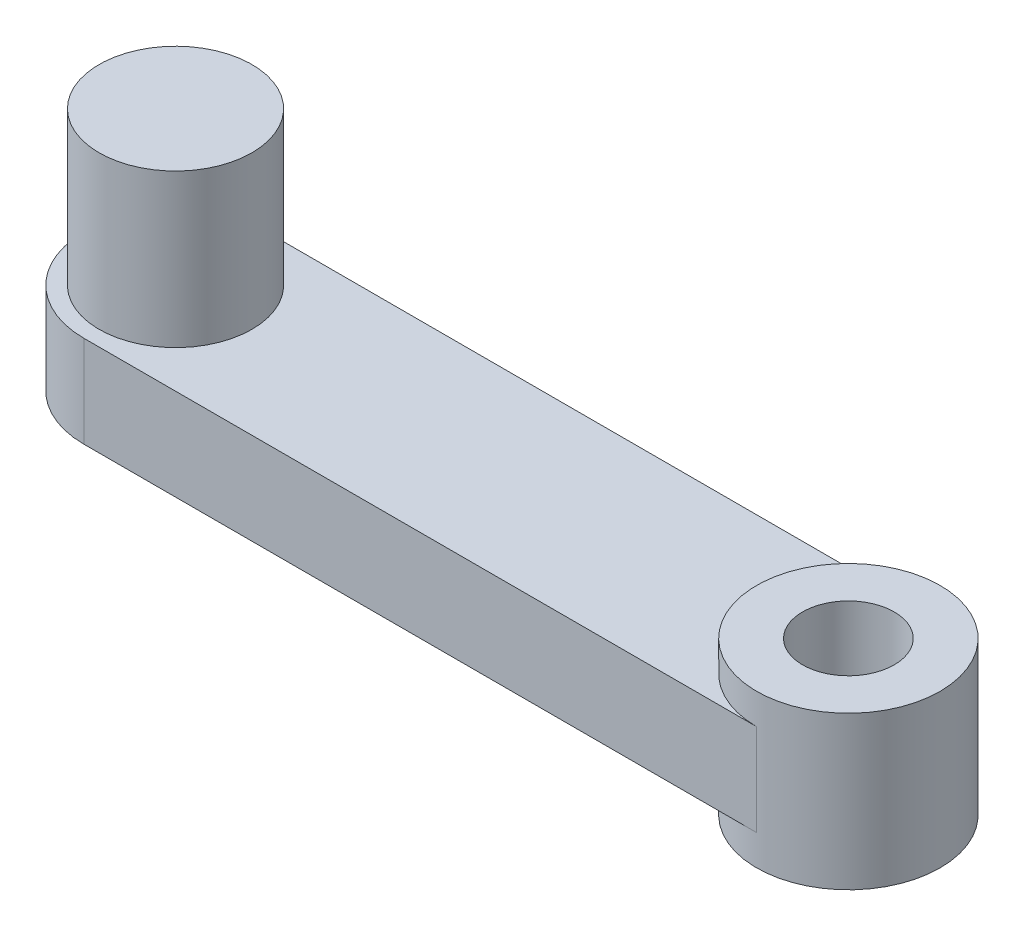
ISO-10303-21;
HEADER;
FILE_DESCRIPTION(('STEP AP214'),'2;1');
FILE_NAME('part.step','',(''),(''),'','','');
FILE_SCHEMA(('AUTOMOTIVE_DESIGN { 1 0 10303 214 1 1 1 1 }'));
ENDSEC;
DATA;
#1=APPLICATION_CONTEXT('core data for automotive mechanical design processes');
#2=APPLICATION_PROTOCOL_DEFINITION('international standard','automotive_design',2000,#1);
#3=PRODUCT_CONTEXT('',#1,'mechanical');
#4=PRODUCT('Part','Part','',(#3));
#5=PRODUCT_RELATED_PRODUCT_CATEGORY('part','',(#4));
#6=PRODUCT_DEFINITION_FORMATION('','',#4);
#7=PRODUCT_DEFINITION_CONTEXT('part definition',#1,'design');
#8=PRODUCT_DEFINITION('design','',#6,#7);
#9=PRODUCT_DEFINITION_SHAPE('','',#8);
#10=(LENGTH_UNIT() NAMED_UNIT(*) SI_UNIT(.MILLI.,.METRE.));
#11=(NAMED_UNIT(*) PLANE_ANGLE_UNIT() SI_UNIT($,.RADIAN.));
#12=(NAMED_UNIT(*) SI_UNIT($,.STERADIAN.) SOLID_ANGLE_UNIT());
#13=UNCERTAINTY_MEASURE_WITH_UNIT(LENGTH_MEASURE(1.E-05),#10,'distance_accuracy_value','');
#14=(GEOMETRIC_REPRESENTATION_CONTEXT(3) GLOBAL_UNCERTAINTY_ASSIGNED_CONTEXT((#13)) GLOBAL_UNIT_ASSIGNED_CONTEXT((#10,
#11,#12)) REPRESENTATION_CONTEXT('',''));
#15=CARTESIAN_POINT('',(0.,0.,0.));
#16=DIRECTION('',(0.,0.,1.));
#17=DIRECTION('',(1.,0.,0.));
#18=AXIS2_PLACEMENT_3D('',#15,#16,#17);
#19=CARTESIAN_POINT('',(0.,8.00000000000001,0.));
#20=DIRECTION('',(0.,1.,0.));
#21=DIRECTION('',(-1.,0.,0.));
#22=AXIS2_PLACEMENT_3D('',#19,#20,#21);
#23=PLANE('',#22);
#24=CARTESIAN_POINT('',(0.,8.00000000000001,0.));
#25=DIRECTION('',(0.,-1.,0.));
#26=DIRECTION('',(1.,0.,0.));
#27=AXIS2_PLACEMENT_3D('',#24,#25,#26);
#28=CIRCLE('',#27,2.5);
#29=CARTESIAN_POINT('',(2.49999999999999,8.00000000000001,0.));
#30=VERTEX_POINT('',#29);
#31=EDGE_CURVE('E20',#30,#30,#28,.T.);
#32=ORIENTED_EDGE('',*,*,#31,.F.);
#33=EDGE_LOOP('',(#32));
#34=FACE_BOUND('',#33,.T.);
#35=ADVANCED_FACE('F17',(#34),#23,.T.);
#36=CARTESIAN_POINT('',(22.,3.00000000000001,0.));
#37=DIRECTION('',(0.,-1.,0.));
#38=DIRECTION('',(1.,0.,0.));
#39=AXIS2_PLACEMENT_3D('',#36,#37,#38);
#40=CYLINDRICAL_SURFACE('',#39,1.5);
#41=CARTESIAN_POINT('',(22.,-0.999999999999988,0.));
#42=DIRECTION('',(0.,-1.,0.));
#43=DIRECTION('',(1.,0.,0.));
#44=AXIS2_PLACEMENT_3D('',#41,#42,#43);
#45=CIRCLE('',#44,1.5);
#46=CARTESIAN_POINT('',(23.5,-0.999999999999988,0.));
#47=VERTEX_POINT('',#46);
#48=EDGE_CURVE('E65',#47,#47,#45,.T.);
#49=ORIENTED_EDGE('',*,*,#48,.T.);
#50=EDGE_LOOP('',(#49));
#51=FACE_BOUND('',#50,.T.);
#52=CARTESIAN_POINT('',(22.,4.,0.));
#53=DIRECTION('',(0.,-1.,0.));
#54=DIRECTION('',(1.,0.,0.));
#55=AXIS2_PLACEMENT_3D('',#52,#53,#54);
#56=CIRCLE('',#55,1.5);
#57=CARTESIAN_POINT('',(23.5,4.,0.));
#58=VERTEX_POINT('',#57);
#59=EDGE_CURVE('E105',#58,#58,#56,.T.);
#60=ORIENTED_EDGE('',*,*,#59,.F.);
#61=EDGE_LOOP('',(#60));
#62=FACE_BOUND('',#61,.T.);
#63=ADVANCED_FACE('F115',(#51,#62),#40,.F.);
#64=CARTESIAN_POINT('',(0.,8.00000000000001,0.));
#65=DIRECTION('',(0.,-1.,0.));
#66=DIRECTION('',(1.,0.,0.));
#67=AXIS2_PLACEMENT_3D('',#64,#65,#66);
#68=CYLINDRICAL_SURFACE('',#67,2.5);
#69=CARTESIAN_POINT('',(0.,3.,0.));
#70=DIRECTION('',(0.,-1.,0.));
#71=DIRECTION('',(1.,0.,0.));
#72=AXIS2_PLACEMENT_3D('',#69,#70,#71);
#73=CIRCLE('',#72,2.5);
#74=CARTESIAN_POINT('',(2.49999999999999,3.,0.));
#75=VERTEX_POINT('',#74);
#76=EDGE_CURVE('E64',#75,#75,#73,.T.);
#77=ORIENTED_EDGE('',*,*,#76,.F.);
#78=EDGE_LOOP('',(#77));
#79=FACE_BOUND('',#78,.T.);
#80=ORIENTED_EDGE('',*,*,#31,.T.);
#81=EDGE_LOOP('',(#80));
#82=FACE_BOUND('',#81,.T.);
#83=ADVANCED_FACE('F112',(#79,#82),#68,.T.);
#84=CARTESIAN_POINT('',(22.,4.,0.));
#85=DIRECTION('',(0.,1.,0.));
#86=DIRECTION('',(-1.,0.,0.));
#87=AXIS2_PLACEMENT_3D('',#84,#85,#86);
#88=PLANE('',#87);
#89=CARTESIAN_POINT('',(22.,4.,0.));
#90=DIRECTION('',(0.,-1.,0.));
#91=DIRECTION('',(1.,0.,0.));
#92=AXIS2_PLACEMENT_3D('',#89,#90,#91);
#93=CIRCLE('',#92,3.);
#94=CARTESIAN_POINT('',(25.,4.,0.));
#95=VERTEX_POINT('',#94);
#96=EDGE_CURVE('E99',#95,#95,#93,.T.);
#97=ORIENTED_EDGE('',*,*,#96,.F.);
#98=EDGE_LOOP('',(#97));
#99=FACE_BOUND('',#98,.T.);
#100=ORIENTED_EDGE('',*,*,#59,.T.);
#101=EDGE_LOOP('',(#100));
#102=FACE_BOUND('',#101,.T.);
#103=ADVANCED_FACE('F155',(#99,#102),#88,.T.);
#104=CARTESIAN_POINT('',(0.,3.,0.));
#105=DIRECTION('',(0.,1.,0.));
#106=DIRECTION('',(-1.,0.,0.));
#107=AXIS2_PLACEMENT_3D('',#104,#105,#106);
#108=PLANE('',#107);
#109=CARTESIAN_POINT('',(0.,3.,0.));
#110=DIRECTION('',(0.,-1.,0.));
#111=DIRECTION('',(1.,0.,0.));
#112=AXIS2_PLACEMENT_3D('',#109,#110,#111);
#113=CIRCLE('',#112,1.5);
#114=CARTESIAN_POINT('',(1.49999999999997,3.,0.));
#115=VERTEX_POINT('',#114);
#116=EDGE_CURVE('E96',#115,#115,#113,.T.);
#117=ORIENTED_EDGE('',*,*,#116,.T.);
#118=EDGE_LOOP('',(#117));
#119=FACE_BOUND('',#118,.T.);
#120=ADVANCED_FACE('F151',(#119),#108,.F.);
#121=CARTESIAN_POINT('',(22.,-0.999999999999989,0.));
#122=DIRECTION('',(0.,1.,0.));
#123=DIRECTION('',(-1.,0.,0.));
#124=AXIS2_PLACEMENT_3D('',#121,#122,#123);
#125=PLANE('',#124);
#126=CARTESIAN_POINT('',(22.,-0.999999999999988,0.));
#127=DIRECTION('',(0.,-1.,0.));
#128=DIRECTION('',(1.,0.,0.));
#129=AXIS2_PLACEMENT_3D('',#126,#127,#128);
#130=CIRCLE('',#129,3.);
#131=CARTESIAN_POINT('',(25.,-0.999999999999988,0.));
#132=VERTEX_POINT('',#131);
#133=EDGE_CURVE('E75',#132,#132,#130,.F.);
#134=ORIENTED_EDGE('',*,*,#133,.F.);
#135=EDGE_LOOP('',(#134));
#136=FACE_BOUND('',#135,.T.);
#137=ORIENTED_EDGE('',*,*,#48,.F.);
#138=EDGE_LOOP('',(#137));
#139=FACE_BOUND('',#138,.T.);
#140=ADVANCED_FACE('F147',(#136,#139),#125,.F.);
#141=CARTESIAN_POINT('',(0.,3.,0.));
#142=DIRECTION('',(0.,1.,0.));
#143=DIRECTION('',(-1.,0.,0.));
#144=AXIS2_PLACEMENT_3D('',#141,#142,#143);
#145=PLANE('',#144);
#146=ORIENTED_EDGE('',*,*,#76,.T.);
#147=EDGE_LOOP('',(#146));
#148=FACE_BOUND('',#147,.T.);
#149=CARTESIAN_POINT('',(0.,3.,0.));
#150=DIRECTION('',(0.,-1.,0.));
#151=DIRECTION('',(1.,0.,0.));
#152=AXIS2_PLACEMENT_3D('',#149,#150,#151);
#153=CIRCLE('',#152,3.);
#154=CARTESIAN_POINT('',(8.97998446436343E-08,3.,3.00000000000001));
#155=VERTEX_POINT('',#154);
#156=CARTESIAN_POINT('',(0.,3.00000000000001,-3.));
#157=VERTEX_POINT('',#156);
#158=EDGE_CURVE('E78',#155,#157,#153,.T.);
#159=ORIENTED_EDGE('',*,*,#158,.F.);
#160=DIRECTION('',(1.,0.,0.));
#161=VECTOR('',#160,1.);
#162=CARTESIAN_POINT('',(0.,3.,3.00000000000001));
#163=LINE('',#162,#161);
#164=CARTESIAN_POINT('',(22.,3.,3.00000000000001));
#165=VERTEX_POINT('',#164);
#166=EDGE_CURVE('E71',#155,#165,#163,.T.);
#167=ORIENTED_EDGE('',*,*,#166,.T.);
#168=CARTESIAN_POINT('',(22.,3.,0.));
#169=DIRECTION('',(0.,-1.,0.));
#170=DIRECTION('',(1.,0.,0.));
#171=AXIS2_PLACEMENT_3D('',#168,#169,#170);
#172=CIRCLE('',#171,3.);
#173=CARTESIAN_POINT('',(21.9999998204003,3.00000000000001,-3.));
#174=VERTEX_POINT('',#173);
#175=EDGE_CURVE('E54',#165,#174,#172,.T.);
#176=ORIENTED_EDGE('',*,*,#175,.T.);
#177=DIRECTION('',(1.,0.,0.));
#178=VECTOR('',#177,1.);
#179=CARTESIAN_POINT('',(0.,3.00000000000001,-3.));
#180=LINE('',#179,#178);
#181=EDGE_CURVE('E84',#157,#174,#180,.T.);
#182=ORIENTED_EDGE('',*,*,#181,.F.);
#183=EDGE_LOOP('',(#159,#167,#176,#182));
#184=FACE_BOUND('',#183,.T.);
#185=ADVANCED_FACE('F77',(#148,#184),#145,.T.);
#186=CARTESIAN_POINT('',(0.,3.,0.));
#187=DIRECTION('',(0.,-1.,0.));
#188=DIRECTION('',(1.,0.,0.));
#189=AXIS2_PLACEMENT_3D('',#186,#187,#188);
#190=CYLINDRICAL_SURFACE('',#189,1.5);
#191=CARTESIAN_POINT('',(0.,0.,0.));
#192=DIRECTION('',(0.,-1.,0.));
#193=DIRECTION('',(1.,0.,0.));
#194=AXIS2_PLACEMENT_3D('',#191,#192,#193);
#195=CIRCLE('',#194,1.5);
#196=CARTESIAN_POINT('',(1.49999999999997,0.,0.));
#197=VERTEX_POINT('',#196);
#198=EDGE_CURVE('E89',#197,#197,#195,.T.);
#199=ORIENTED_EDGE('',*,*,#198,.T.);
#200=EDGE_LOOP('',(#199));
#201=FACE_BOUND('',#200,.T.);
#202=ORIENTED_EDGE('',*,*,#116,.F.);
#203=EDGE_LOOP('',(#202));
#204=FACE_BOUND('',#203,.T.);
#205=ADVANCED_FACE('F140',(#201,#204),#190,.F.);
#206=CARTESIAN_POINT('',(0.,3.,0.));
#207=DIRECTION('',(0.,-1.,0.));
#208=DIRECTION('',(1.,0.,0.));
#209=AXIS2_PLACEMENT_3D('',#206,#207,#208);
#210=CYLINDRICAL_SURFACE('',#209,3.);
#211=ORIENTED_EDGE('',*,*,#158,.T.);
#212=DIRECTION('',(0.,1.,0.));
#213=VECTOR('',#212,1.);
#214=CARTESIAN_POINT('',(0.,3.00000000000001,-3.));
#215=LINE('',#214,#213);
#216=CARTESIAN_POINT('',(0.,0.,-3.));
#217=VERTEX_POINT('',#216);
#218=EDGE_CURVE('E94',#217,#157,#215,.T.);
#219=ORIENTED_EDGE('',*,*,#218,.F.);
#220=CARTESIAN_POINT('',(0.,0.,0.));
#221=DIRECTION('',(0.,-1.,0.));
#222=DIRECTION('',(1.,0.,0.));
#223=AXIS2_PLACEMENT_3D('',#220,#221,#222);
#224=CIRCLE('',#223,3.);
#225=CARTESIAN_POINT('',(8.97998446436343E-08,0.,3.));
#226=VERTEX_POINT('',#225);
#227=EDGE_CURVE('E86',#217,#226,#224,.F.);
#228=ORIENTED_EDGE('',*,*,#227,.T.);
#229=DIRECTION('',(0.,1.,0.));
#230=VECTOR('',#229,1.);
#231=CARTESIAN_POINT('',(1.79599717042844E-07,3.,3.00000000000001));
#232=LINE('',#231,#230);
#233=EDGE_CURVE('E79',#226,#155,#232,.T.);
#234=ORIENTED_EDGE('',*,*,#233,.T.);
#235=EDGE_LOOP('',(#211,#219,#228,#234));
#236=FACE_BOUND('',#235,.T.);
#237=ADVANCED_FACE('F137',(#236),#210,.T.);
#238=CARTESIAN_POINT('',(0.,3.,3.00000000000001));
#239=DIRECTION('',(0.,0.,-1.));
#240=DIRECTION('',(0.,1.,0.));
#241=AXIS2_PLACEMENT_3D('',#238,#239,#240);
#242=PLANE('',#241);
#243=DIRECTION('',(0.,1.,0.));
#244=VECTOR('',#243,1.);
#245=CARTESIAN_POINT('',(22.,3.,3.00000000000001));
#246=LINE('',#245,#244);
#247=CARTESIAN_POINT('',(22.,0.,3.00000000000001));
#248=VERTEX_POINT('',#247);
#249=EDGE_CURVE('E59',#165,#248,#246,.F.);
#250=ORIENTED_EDGE('',*,*,#249,.F.);
#251=ORIENTED_EDGE('',*,*,#166,.F.);
#252=ORIENTED_EDGE('',*,*,#233,.F.);
#253=DIRECTION('',(-1.,0.,0.));
#254=VECTOR('',#253,1.);
#255=CARTESIAN_POINT('',(0.,0.,3.));
#256=LINE('',#255,#254);
#257=EDGE_CURVE('E74',#226,#248,#256,.F.);
#258=ORIENTED_EDGE('',*,*,#257,.T.);
#259=EDGE_LOOP('',(#250,#251,#252,#258));
#260=FACE_BOUND('',#259,.T.);
#261=ADVANCED_FACE('F70',(#260),#242,.F.);
#262=CARTESIAN_POINT('',(22.,3.00000000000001,0.));
#263=DIRECTION('',(0.,-1.,0.));
#264=DIRECTION('',(1.,0.,0.));
#265=AXIS2_PLACEMENT_3D('',#262,#263,#264);
#266=CYLINDRICAL_SURFACE('',#265,3.);
#267=ORIENTED_EDGE('',*,*,#96,.T.);
#268=EDGE_LOOP('',(#267));
#269=FACE_BOUND('',#268,.T.);
#270=ORIENTED_EDGE('',*,*,#249,.T.);
#271=CARTESIAN_POINT('',(22.,0.,0.));
#272=DIRECTION('',(0.,-1.,0.));
#273=DIRECTION('',(1.,0.,0.));
#274=AXIS2_PLACEMENT_3D('',#271,#272,#273);
#275=CIRCLE('',#274,3.);
#276=CARTESIAN_POINT('',(21.9999998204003,0.,-3.));
#277=VERTEX_POINT('',#276);
#278=EDGE_CURVE('E26',#248,#277,#275,.T.);
#279=ORIENTED_EDGE('',*,*,#278,.T.);
#280=DIRECTION('',(0.,1.,0.));
#281=VECTOR('',#280,1.);
#282=CARTESIAN_POINT('',(21.9999996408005,3.00000000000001,-3.));
#283=LINE('',#282,#281);
#284=EDGE_CURVE('E34',#174,#277,#283,.F.);
#285=ORIENTED_EDGE('',*,*,#284,.F.);
#286=ORIENTED_EDGE('',*,*,#175,.F.);
#287=EDGE_LOOP('',(#270,#279,#285,#286));
#288=FACE_BOUND('',#287,.T.);
#289=ORIENTED_EDGE('',*,*,#133,.T.);
#290=EDGE_LOOP('',(#289));
#291=FACE_BOUND('',#290,.T.);
#292=ADVANCED_FACE('F56',(#269,#288,#291),#266,.T.);
#293=CARTESIAN_POINT('',(0.,3.00000000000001,-3.));
#294=DIRECTION('',(0.,0.,-1.));
#295=DIRECTION('',(0.,1.,0.));
#296=AXIS2_PLACEMENT_3D('',#293,#294,#295);
#297=PLANE('',#296);
#298=ORIENTED_EDGE('',*,*,#181,.T.);
#299=ORIENTED_EDGE('',*,*,#284,.T.);
#300=DIRECTION('',(-1.,0.,0.));
#301=VECTOR('',#300,1.);
#302=CARTESIAN_POINT('',(0.,0.,-2.99999999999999));
#303=LINE('',#302,#301);
#304=EDGE_CURVE('E11',#277,#217,#303,.T.);
#305=ORIENTED_EDGE('',*,*,#304,.T.);
#306=ORIENTED_EDGE('',*,*,#218,.T.);
#307=EDGE_LOOP('',(#298,#299,#305,#306));
#308=FACE_BOUND('',#307,.T.);
#309=ADVANCED_FACE('F123',(#308),#297,.T.);
#310=CARTESIAN_POINT('',(0.,0.,0.));
#311=DIRECTION('',(0.,1.,0.));
#312=DIRECTION('',(-1.,0.,0.));
#313=AXIS2_PLACEMENT_3D('',#310,#311,#312);
#314=PLANE('',#313);
#315=ORIENTED_EDGE('',*,*,#278,.F.);
#316=ORIENTED_EDGE('',*,*,#257,.F.);
#317=ORIENTED_EDGE('',*,*,#227,.F.);
#318=ORIENTED_EDGE('',*,*,#304,.F.);
#319=EDGE_LOOP('',(#315,#316,#317,#318));
#320=FACE_BOUND('',#319,.T.);
#321=ORIENTED_EDGE('',*,*,#198,.F.);
#322=EDGE_LOOP('',(#321));
#323=FACE_BOUND('',#322,.T.);
#324=ADVANCED_FACE('F121',(#320,#323),#314,.F.);
#325=CLOSED_SHELL('',(#35,#63,#83,#103,#120,#140,#185,#205,#237,#261,#292,#309,#324));
#326=MANIFOLD_SOLID_BREP('B1',#325);
#327=ADVANCED_BREP_SHAPE_REPRESENTATION('',(#18,#326),#14);
#328=SHAPE_DEFINITION_REPRESENTATION(#9,#327);
ENDSEC;
END-ISO-10303-21;
